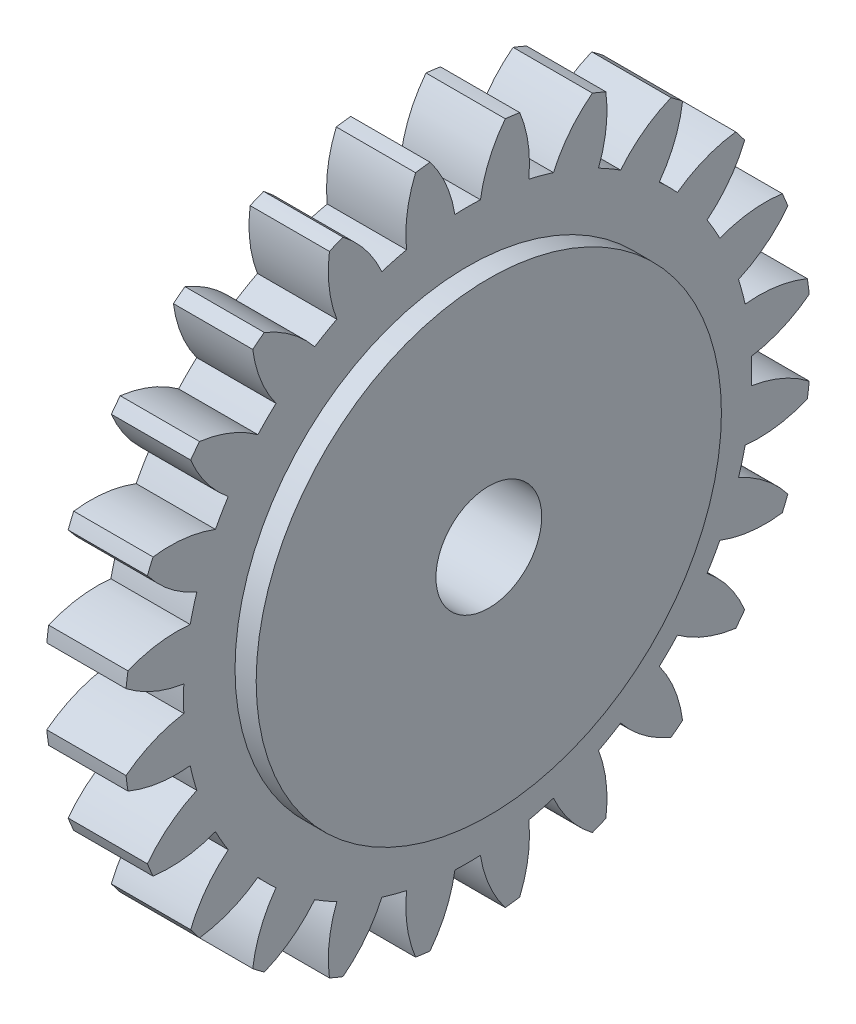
from build123d import *

# Parameters (mm, degrees)
BASPROSKE_W      = 1.5
BASPROSKE_H      = 6.5
TOOTHCUT_DEPTH   = 10.313968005
TEETHCUTS_COUNT  = 24
BORSKE_R         = 1
BORE_DEPTH       = 50.0000508
EXTRUSION1_START = 0.4
ESQUISSE1_R      = 4.4
ESQUISSE1_R_2    = 1
EXTRUSION1_DEPTH = 0.4
ESQUISSE2_R      = 2.05
ESQUISSE2_R_2    = 1
EXTRUSION2_DEPTH = 0.45


with BuildPart() as part:
    # BasProSke → Base-Revolve (revolve)
    with BuildSketch(Plane(origin=(0, 0, 0), x_dir=(1, 0, 0), z_dir=(0, 1, 0)), mode=Mode.PRIVATE) as base_revolve_sk:
        with Locations((0.75, 3.25)):
            Rectangle(BASPROSKE_W, BASPROSKE_H)
    revolve(base_revolve_sk.sketch.rotate(Axis((-10, 0, 0), (1, 0, 0)), 180), axis=Axis((-10, 0, 0), (1, 0, 0)))

    # TooCutSke → ToothCut (cut, through all)
    with BuildSketch(Plane(origin=(0, 0, 0), x_dir=(0, 0, -1), z_dir=(1, 0, 0))):
        with BuildLine():
            ThreePointArc((0.241646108, 5.368564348), (0, 5.374), (-0.241646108, 5.368564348))
            ThreePointArc((-0.241646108, 5.368564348), (-0.413699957, 5.957993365), (-0.729686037, 6.48447403))
            ThreePointArc((-0.729686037, 6.48447403), (0, 6.5254), (0.729686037, 6.48447403))
            ThreePointArc((0.729686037, 6.48447403), (0.413699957, 5.957993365), (0.241646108, 5.368564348))
        make_face()
    toothcut = extrude(amount=TOOTHCUT_DEPTH, mode=Mode.SUBTRACT)

    # TeethCuts: ToothCut ×24 about axis
    teethcuts_axis = Axis((0, 0, 0), (1, 0, 0))
    for i in range(1, TEETHCUTS_COUNT):
        add(toothcut.rotate(teethcuts_axis, i * 360 / TEETHCUTS_COUNT), mode=Mode.SUBTRACT)

    # BorSke → Bore (cut, symmetric)
    with BuildSketch(Plane(origin=(0, 0, 0), x_dir=(0, 0, -1), z_dir=(1, 0, 0))):
        with Locations(Location((0, 0, 0), (0, 0, 180))):
            Circle(BORSKE_R)
    extrude(amount=BORE_DEPTH, both=True, mode=Mode.SUBTRACT)

    # Esquisse1 → Extrusion1 (add)
    with BuildSketch(Plane(origin=(1.5, 0, 0), x_dir=(0, 0, -1), z_dir=(1, 0, 0)).offset(EXTRUSION1_START)):
        with Locations(Location((0, 0, 0), (0, 0, 180))):
            Circle(ESQUISSE1_R)
        Circle(ESQUISSE1_R_2, mode=Mode.SUBTRACT)
    extrude(amount=-EXTRUSION1_DEPTH)

    # Esquisse2 → Extrusion2 (add)
    with BuildSketch(Plane.ZY):
        with Locations(Location((0, 0, 0), (0, 0, 180))):
            Circle(ESQUISSE2_R)
        Circle(ESQUISSE2_R_2, mode=Mode.SUBTRACT)
    extrude(amount=EXTRUSION2_DEPTH)


solid = part.part
